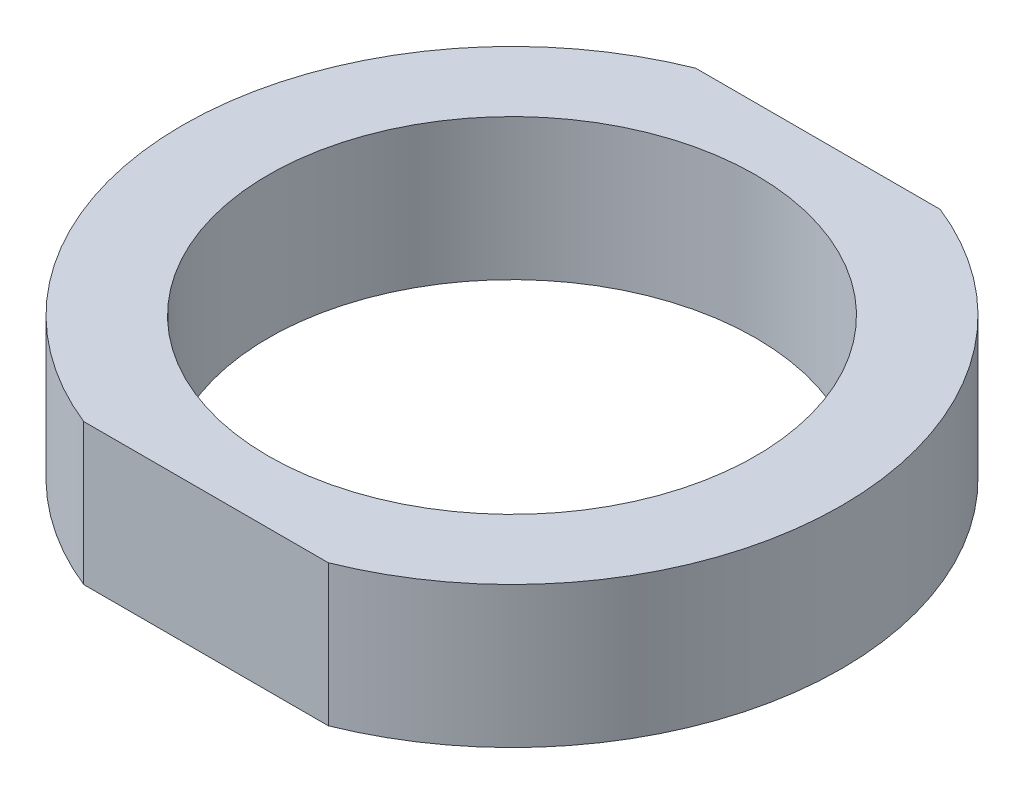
ISO-10303-21;
HEADER;
FILE_DESCRIPTION(('STEP AP214'),'2;1');
FILE_NAME('part.step','',(''),(''),'','','');
FILE_SCHEMA(('AUTOMOTIVE_DESIGN { 1 0 10303 214 1 1 1 1 }'));
ENDSEC;
DATA;
#1=APPLICATION_CONTEXT('core data for automotive mechanical design processes');
#2=APPLICATION_PROTOCOL_DEFINITION('international standard','automotive_design',2000,#1);
#3=PRODUCT_CONTEXT('',#1,'mechanical');
#4=PRODUCT('Part','Part','',(#3));
#5=PRODUCT_RELATED_PRODUCT_CATEGORY('part','',(#4));
#6=PRODUCT_DEFINITION_FORMATION('','',#4);
#7=PRODUCT_DEFINITION_CONTEXT('part definition',#1,'design');
#8=PRODUCT_DEFINITION('design','',#6,#7);
#9=PRODUCT_DEFINITION_SHAPE('','',#8);
#10=(LENGTH_UNIT() NAMED_UNIT(*) SI_UNIT(.MILLI.,.METRE.));
#11=(NAMED_UNIT(*) PLANE_ANGLE_UNIT() SI_UNIT($,.RADIAN.));
#12=(NAMED_UNIT(*) SI_UNIT($,.STERADIAN.) SOLID_ANGLE_UNIT());
#13=UNCERTAINTY_MEASURE_WITH_UNIT(LENGTH_MEASURE(1.E-05),#10,'distance_accuracy_value','');
#14=(GEOMETRIC_REPRESENTATION_CONTEXT(3) GLOBAL_UNCERTAINTY_ASSIGNED_CONTEXT((#13)) GLOBAL_UNIT_ASSIGNED_CONTEXT((#10,
#11,#12)) REPRESENTATION_CONTEXT('',''));
#15=CARTESIAN_POINT('',(0.,0.,0.));
#16=DIRECTION('',(0.,0.,1.));
#17=DIRECTION('',(1.,0.,0.));
#18=AXIS2_PLACEMENT_3D('',#15,#16,#17);
#19=CARTESIAN_POINT('',(0.,6.,0.));
#20=DIRECTION('',(0.,1.,0.));
#21=DIRECTION('',(0.,0.,1.));
#22=AXIS2_PLACEMENT_3D('',#19,#20,#21);
#23=PLANE('',#22);
#24=CARTESIAN_POINT('',(0.,6.,0.));
#25=DIRECTION('',(0.,1.,0.));
#26=DIRECTION('',(0.,0.,1.));
#27=AXIS2_PLACEMENT_3D('',#24,#25,#26);
#28=CIRCLE('',#27,14.);
#29=CARTESIAN_POINT('',(-5.19615242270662,6.,-13.));
#30=VERTEX_POINT('',#29);
#31=CARTESIAN_POINT('',(-5.19615242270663,6.,13.));
#32=VERTEX_POINT('',#31);
#33=EDGE_CURVE('E69',#30,#32,#28,.T.);
#34=ORIENTED_EDGE('',*,*,#33,.T.);
#35=DIRECTION('',(1.,0.,0.));
#36=VECTOR('',#35,1.);
#37=CARTESIAN_POINT('',(-5.19615242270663,6.,13.));
#38=LINE('',#37,#36);
#39=CARTESIAN_POINT('',(5.19615242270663,6.,13.));
#40=VERTEX_POINT('',#39);
#41=EDGE_CURVE('E64',#32,#40,#38,.T.);
#42=ORIENTED_EDGE('',*,*,#41,.T.);
#43=CARTESIAN_POINT('',(0.,6.,0.));
#44=DIRECTION('',(0.,1.,0.));
#45=DIRECTION('',(0.,0.,1.));
#46=AXIS2_PLACEMENT_3D('',#43,#44,#45);
#47=CIRCLE('',#46,14.);
#48=CARTESIAN_POINT('',(5.19615242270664,6.,-13.));
#49=VERTEX_POINT('',#48);
#50=EDGE_CURVE('E67',#40,#49,#47,.T.);
#51=ORIENTED_EDGE('',*,*,#50,.T.);
#52=DIRECTION('',(-1.,0.,0.));
#53=VECTOR('',#52,1.);
#54=CARTESIAN_POINT('',(-5.19615242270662,6.,-13.));
#55=LINE('',#54,#53);
#56=EDGE_CURVE('E34',#49,#30,#55,.T.);
#57=ORIENTED_EDGE('',*,*,#56,.T.);
#58=EDGE_LOOP('',(#34,#42,#51,#57));
#59=FACE_BOUND('',#58,.T.);
#60=CARTESIAN_POINT('',(0.,6.,0.));
#61=DIRECTION('',(0.,1.,0.));
#62=DIRECTION('',(0.,0.,1.));
#63=AXIS2_PLACEMENT_3D('',#60,#61,#62);
#64=CIRCLE('',#63,10.35);
#65=CARTESIAN_POINT('',(0.,6.,10.35));
#66=VERTEX_POINT('',#65);
#67=EDGE_CURVE('E84',#66,#66,#64,.T.);
#68=ORIENTED_EDGE('',*,*,#67,.F.);
#69=EDGE_LOOP('',(#68));
#70=FACE_BOUND('',#69,.T.);
#71=ADVANCED_FACE('F17',(#59,#70),#23,.T.);
#72=CARTESIAN_POINT('',(0.,0.,0.));
#73=DIRECTION('',(0.,1.,0.));
#74=DIRECTION('',(0.,0.,1.));
#75=AXIS2_PLACEMENT_3D('',#72,#73,#74);
#76=PLANE('',#75);
#77=CARTESIAN_POINT('',(0.,0.,0.));
#78=DIRECTION('',(0.,1.,0.));
#79=DIRECTION('',(0.,0.,1.));
#80=AXIS2_PLACEMENT_3D('',#77,#78,#79);
#81=CIRCLE('',#80,14.);
#82=CARTESIAN_POINT('',(-5.19615242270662,0.,-13.));
#83=VERTEX_POINT('',#82);
#84=CARTESIAN_POINT('',(-5.19615242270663,0.,13.));
#85=VERTEX_POINT('',#84);
#86=EDGE_CURVE('E81',#83,#85,#81,.T.);
#87=ORIENTED_EDGE('',*,*,#86,.F.);
#88=DIRECTION('',(-1.,0.,0.));
#89=VECTOR('',#88,1.);
#90=CARTESIAN_POINT('',(-5.19615242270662,0.,-13.));
#91=LINE('',#90,#89);
#92=CARTESIAN_POINT('',(5.19615242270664,0.,-13.));
#93=VERTEX_POINT('',#92);
#94=EDGE_CURVE('E57',#93,#83,#91,.T.);
#95=ORIENTED_EDGE('',*,*,#94,.F.);
#96=CARTESIAN_POINT('',(0.,0.,0.));
#97=DIRECTION('',(0.,1.,0.));
#98=DIRECTION('',(0.,0.,1.));
#99=AXIS2_PLACEMENT_3D('',#96,#97,#98);
#100=CIRCLE('',#99,14.);
#101=CARTESIAN_POINT('',(5.19615242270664,0.,13.));
#102=VERTEX_POINT('',#101);
#103=EDGE_CURVE('E51',#102,#93,#100,.T.);
#104=ORIENTED_EDGE('',*,*,#103,.F.);
#105=DIRECTION('',(1.,0.,0.));
#106=VECTOR('',#105,1.);
#107=CARTESIAN_POINT('',(-5.19615242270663,0.,13.));
#108=LINE('',#107,#106);
#109=EDGE_CURVE('E73',#85,#102,#108,.T.);
#110=ORIENTED_EDGE('',*,*,#109,.F.);
#111=EDGE_LOOP('',(#87,#95,#104,#110));
#112=FACE_BOUND('',#111,.T.);
#113=CARTESIAN_POINT('',(0.,0.,0.));
#114=DIRECTION('',(0.,1.,0.));
#115=DIRECTION('',(0.,0.,1.));
#116=AXIS2_PLACEMENT_3D('',#113,#114,#115);
#117=CIRCLE('',#116,10.35);
#118=CARTESIAN_POINT('',(0.,0.,10.35));
#119=VERTEX_POINT('',#118);
#120=EDGE_CURVE('E96',#119,#119,#117,.T.);
#121=ORIENTED_EDGE('',*,*,#120,.T.);
#122=EDGE_LOOP('',(#121));
#123=FACE_BOUND('',#122,.T.);
#124=ADVANCED_FACE('F92',(#112,#123),#76,.F.);
#125=CARTESIAN_POINT('',(0.,6.,0.));
#126=DIRECTION('',(0.,-1.,0.));
#127=DIRECTION('',(0.,0.,-1.));
#128=AXIS2_PLACEMENT_3D('',#125,#126,#127);
#129=CYLINDRICAL_SURFACE('',#128,14.);
#130=ORIENTED_EDGE('',*,*,#86,.T.);
#131=DIRECTION('',(0.,-1.,0.));
#132=VECTOR('',#131,1.);
#133=CARTESIAN_POINT('',(-5.19615242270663,6.,13.));
#134=LINE('',#133,#132);
#135=EDGE_CURVE('E11',#32,#85,#134,.T.);
#136=ORIENTED_EDGE('',*,*,#135,.F.);
#137=ORIENTED_EDGE('',*,*,#33,.F.);
#138=DIRECTION('',(0.,-1.,0.));
#139=VECTOR('',#138,1.);
#140=CARTESIAN_POINT('',(-5.19615242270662,6.,-13.));
#141=LINE('',#140,#139);
#142=EDGE_CURVE('E77',#30,#83,#141,.T.);
#143=ORIENTED_EDGE('',*,*,#142,.T.);
#144=EDGE_LOOP('',(#130,#136,#137,#143));
#145=FACE_BOUND('',#144,.T.);
#146=ADVANCED_FACE('F19',(#145),#129,.T.);
#147=CARTESIAN_POINT('',(-5.19615242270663,6.,13.));
#148=DIRECTION('',(0.,0.,-1.));
#149=DIRECTION('',(-1.,0.,0.));
#150=AXIS2_PLACEMENT_3D('',#147,#148,#149);
#151=PLANE('',#150);
#152=ORIENTED_EDGE('',*,*,#109,.T.);
#153=DIRECTION('',(0.,-1.,0.));
#154=VECTOR('',#153,1.);
#155=CARTESIAN_POINT('',(5.19615242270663,6.,13.));
#156=LINE('',#155,#154);
#157=EDGE_CURVE('E26',#40,#102,#156,.T.);
#158=ORIENTED_EDGE('',*,*,#157,.F.);
#159=ORIENTED_EDGE('',*,*,#41,.F.);
#160=ORIENTED_EDGE('',*,*,#135,.T.);
#161=EDGE_LOOP('',(#152,#158,#159,#160));
#162=FACE_BOUND('',#161,.T.);
#163=ADVANCED_FACE('F72',(#162),#151,.F.);
#164=CARTESIAN_POINT('',(0.,6.,0.));
#165=DIRECTION('',(0.,-1.,0.));
#166=DIRECTION('',(0.,0.,-1.));
#167=AXIS2_PLACEMENT_3D('',#164,#165,#166);
#168=CYLINDRICAL_SURFACE('',#167,14.);
#169=ORIENTED_EDGE('',*,*,#103,.T.);
#170=DIRECTION('',(0.,-1.,0.));
#171=VECTOR('',#170,1.);
#172=CARTESIAN_POINT('',(5.19615242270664,6.,-13.));
#173=LINE('',#172,#171);
#174=EDGE_CURVE('E74',#49,#93,#173,.T.);
#175=ORIENTED_EDGE('',*,*,#174,.F.);
#176=ORIENTED_EDGE('',*,*,#50,.F.);
#177=ORIENTED_EDGE('',*,*,#157,.T.);
#178=EDGE_LOOP('',(#169,#175,#176,#177));
#179=FACE_BOUND('',#178,.T.);
#180=ADVANCED_FACE('F75',(#179),#168,.T.);
#181=CARTESIAN_POINT('',(-5.19615242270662,6.,-13.));
#182=DIRECTION('',(0.,0.,1.));
#183=DIRECTION('',(1.,0.,0.));
#184=AXIS2_PLACEMENT_3D('',#181,#182,#183);
#185=PLANE('',#184);
#186=ORIENTED_EDGE('',*,*,#94,.T.);
#187=ORIENTED_EDGE('',*,*,#142,.F.);
#188=ORIENTED_EDGE('',*,*,#56,.F.);
#189=ORIENTED_EDGE('',*,*,#174,.T.);
#190=EDGE_LOOP('',(#186,#187,#188,#189));
#191=FACE_BOUND('',#190,.T.);
#192=ADVANCED_FACE('F89',(#191),#185,.F.);
#193=CARTESIAN_POINT('',(0.,6.,0.));
#194=DIRECTION('',(0.,-1.,0.));
#195=DIRECTION('',(0.,0.,-1.));
#196=AXIS2_PLACEMENT_3D('',#193,#194,#195);
#197=CYLINDRICAL_SURFACE('',#196,10.35);
#198=ORIENTED_EDGE('',*,*,#67,.T.);
#199=EDGE_LOOP('',(#198));
#200=FACE_BOUND('',#199,.T.);
#201=ORIENTED_EDGE('',*,*,#120,.F.);
#202=EDGE_LOOP('',(#201));
#203=FACE_BOUND('',#202,.T.);
#204=ADVANCED_FACE('F102',(#200,#203),#197,.F.);
#205=CLOSED_SHELL('',(#71,#124,#146,#163,#180,#192,#204));
#206=MANIFOLD_SOLID_BREP('B1',#205);
#207=ADVANCED_BREP_SHAPE_REPRESENTATION('',(#18,#206),#14);
#208=SHAPE_DEFINITION_REPRESENTATION(#9,#207);
ENDSEC;
END-ISO-10303-21;
